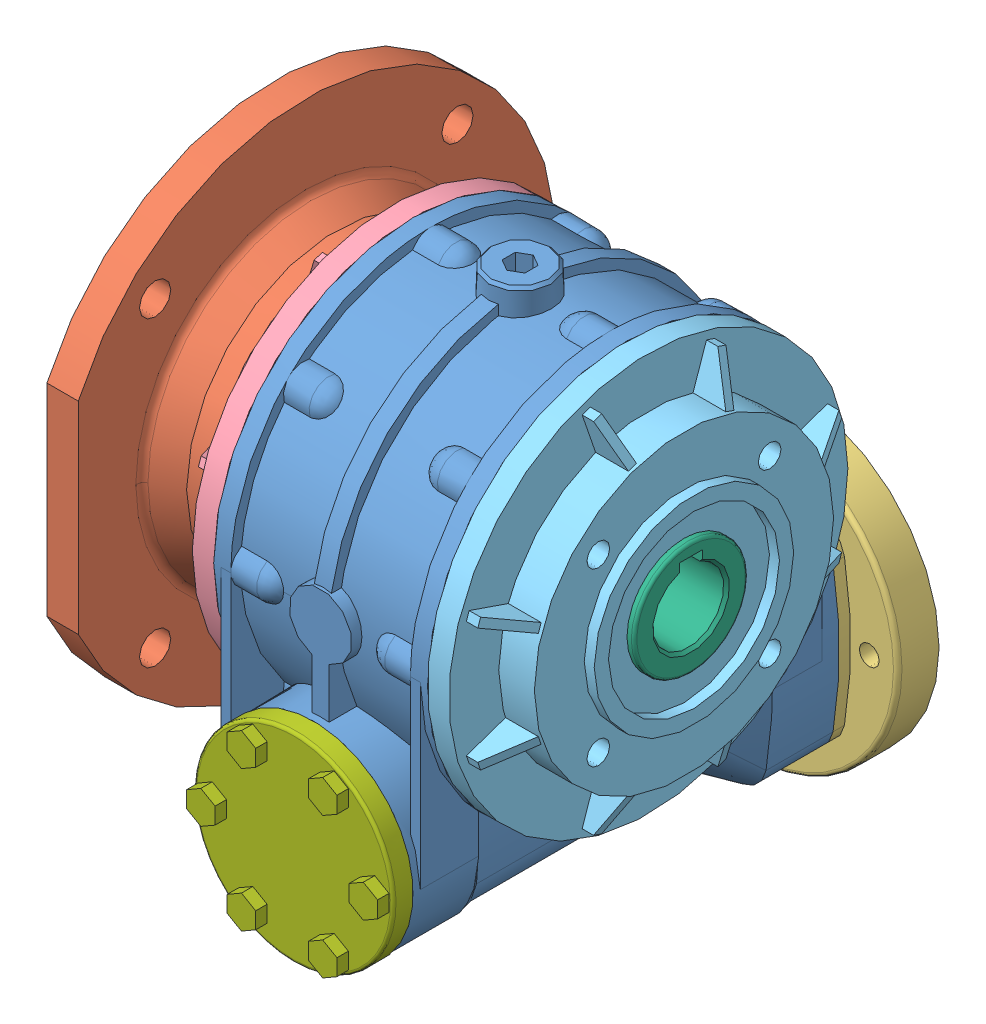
SolidWorks assembly 3930F-REDUCTEUR.sldasm, configuration Défaut (file format 3400). Lengths in mm.
Overall size (147 203 178).
8 component instances, 8 part files, 9 mates.
Components (placement in the parent):
- 3930F-1: 3930F.sldprt [Défaut] at origin size (75 174.74 148.5)
- 3930J-7-1: 3930J-7.sldprt [Défaut] at (0 0 190) x (-1 0 0) z (0 0 -1) size (28.5 175 167.5)
- 3930J-3-1: 3930J-3.sldprt [Défaut] at origin size (105 105 18.5)
- 3930J-8-1: 3930J-8.sldprt [Défaut] at (0 0 190) x (-1 0 0) z (0 0 -1) size (23.5 140 140)
- 3930J-9-1: 3930J-9.sldprt [Défaut] at (0 0 190) x (-1 0 0) z (0 0 -1) size (23.5 140 140)
- 3930J-11-1: 3930J-11.sldprt [Défaut] at origin size (120 40 40)
- 3930J-14-1: 3930J-14.sldprt [Défaut] at origin size (70 70 11)
- 3930J-1-1: 3930J-1.sldprt [Défaut] at origin size (35 35 92)
Mates (geometry in assembly coordinates):
- Coïncidente1: coincident anti-aligned: plane of ? through (-57.5 116.13 148.13) normal (1 0 0); plane of ? through (-57.5 9.87 148.13) normal (-1 0 0)
- Coaxiale1: concentric anti-aligned: cylinder of ?; cylinder of ?
- Parallèle1: parallel aligned: plane of ? through (0 0 190) normal (0 1 0); plane of ? through (0 0 190) normal (0 1 0)
- Coïncidente4: coincident anti-aligned: plane of ? through (-37.5 -60 19.9) normal (-1 0 0); plane of ? through (-37.5 -7.84 24.16) normal (1 0 0)
- Coaxiale2: concentric aligned: cylinder of ?; cylinder of ?
- Coïncidente5: coincident aligned: plane of ? through (0 0 0) normal (0 1 0); plane of ? through (0 0 190) normal (0 1 0)
- Coïncidente6: coincident anti-aligned: plane of ? through (37.5 -60 19.9) normal (1 0 0); plane of ? through (37.5 -7.84 165.84) normal (-1 0 0)
- Coaxiale3: concentric anti-aligned: cylinder of ?; cylinder of ?
- Parallèle2: parallel aligned: plane of ? through (0 0 190) normal (0 1 0); plane of ? through (0 0 190) normal (0 1 0)
